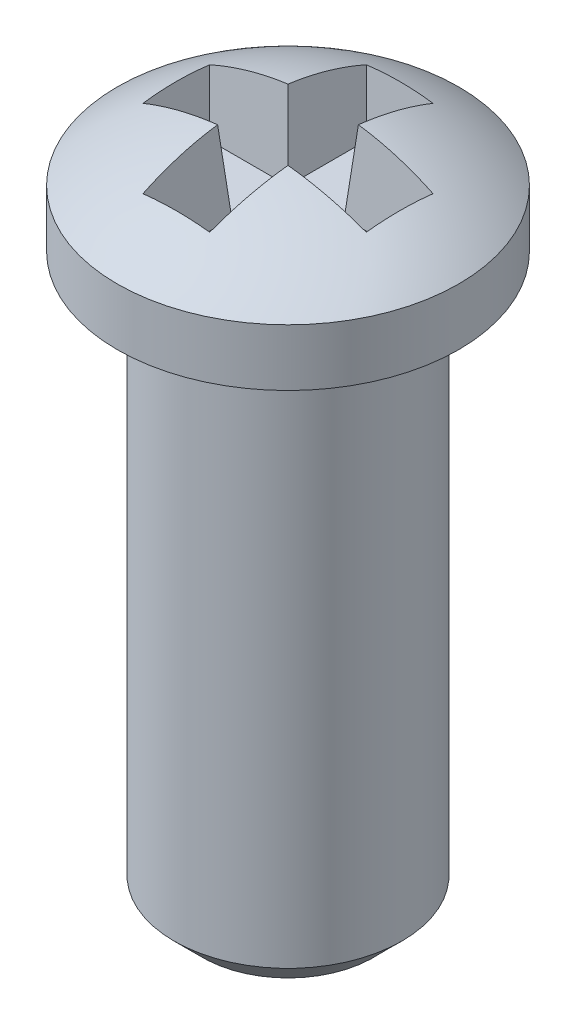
from build123d import *

# Parameters (mm, degrees)
CHAMFER1_SIZE      = 0.5
CUT_EXTRUDE1_DEPTH = 1.5
CUT_EXTRUDE1_DRAFT = -5


with BuildPart() as part:
    # Sketch1 → Revolve1 (revolve)
    with BuildSketch(Plane(origin=(0, 0, 0), x_dir=(0, 0, -1), z_dir=(1, 0, 0))):
        with BuildLine():
            Line((0, 0), (-2, 0))
            Line((-2, 0), (-2, 10))
            Line((-2, 10), (-3, 10))
            Line((-3, 10), (-3, 11))
            ThreePointArc((-3, 11), (-1.58113883, 11.74341649), (0, 12))
            Line((0, 12), (0, 0))
        make_face()
    revolve(axis=Axis((0, 0, 0), (0, -1, 0)))

    # Chamfer1
    chamfer1_edges = [part.edges().sort_by_distance(p)[0] for p in [
        (0, 0, -2),
    ]]
    chamfer(chamfer1_edges, length=CHAMFER1_SIZE)


with BuildPart() as cut_extrude1_tool:
    # Sketch2 → Cut-Extrude1 (with draft: the straight prism first)
    with BuildSketch(Plane(origin=(0, 12, 0), x_dir=(-1, 0, 0), z_dir=(0, 1, 0))):
        Polygon((-2, 0.625), (-2, -0.625), (-0.625, -0.625), (-0.625, -2), (0.625, -2), (0.625, -0.625), (2, -0.625), (2, 0.625), (0.625, 0.625), (0.625, 2), (-0.625, 2), (-0.625, 0.625), align=None)
    extrude(amount=-CUT_EXTRUDE1_DEPTH)
    # Cut-Extrude1: the draft: its side faces are tilted about the plane it starts from
    cut_extrude1_sides = [cut_extrude1_tool.faces().sort_by_distance(p)[0] for p in [
        (2, 11.25, 0),
        (1.3125, 11.25, -0.625),
        (0.625, 11.25, -1.3125),
        (0, 11.25, -2),
        (-0.625, 11.25, -1.3125),
        (-1.3125, 11.25, -0.625),
        (-2, 11.25, 0),
        (-1.3125, 11.25, 0.625),
        (-0.625, 11.25, 1.3125),
        (0, 11.25, 2),
        (0.625, 11.25, 1.3125),
        (1.3125, 11.25, 0.625),
    ]]
    draft(cut_extrude1_sides, Plane(origin=(0, 12, 0), x_dir=(-1, 0, 0), z_dir=(0, 1, 0)), CUT_EXTRUDE1_DRAFT)


with BuildPart() as part_1:
    add(part.part)

    # Cut-Extrude1: cut by cut_extrude1_tool
    add(cut_extrude1_tool.part, mode=Mode.SUBTRACT)


solid = part_1.part
